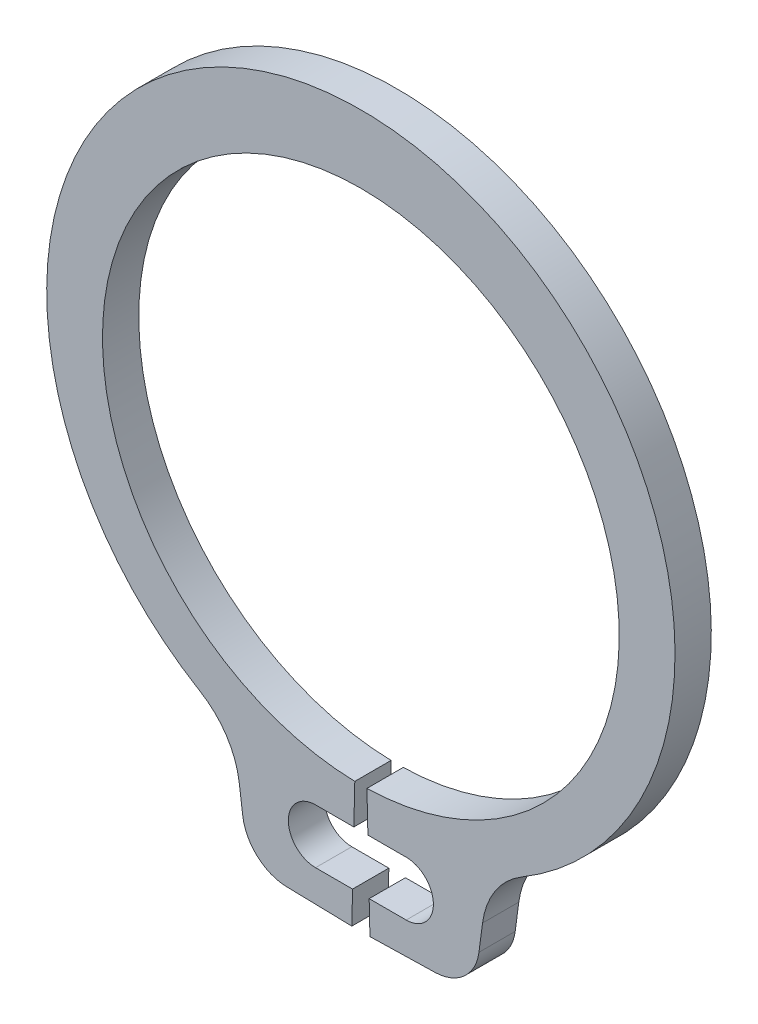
ISO-10303-21;
HEADER;
FILE_DESCRIPTION(('STEP AP214'),'2;1');
FILE_NAME('part.step','',(''),(''),'','','');
FILE_SCHEMA(('AUTOMOTIVE_DESIGN { 1 0 10303 214 1 1 1 1 }'));
ENDSEC;
DATA;
#1=APPLICATION_CONTEXT('core data for automotive mechanical design processes');
#2=APPLICATION_PROTOCOL_DEFINITION('international standard','automotive_design',2000,#1);
#3=PRODUCT_CONTEXT('',#1,'mechanical');
#4=PRODUCT('Part','Part','',(#3));
#5=PRODUCT_RELATED_PRODUCT_CATEGORY('part','',(#4));
#6=PRODUCT_DEFINITION_FORMATION('','',#4);
#7=PRODUCT_DEFINITION_CONTEXT('part definition',#1,'design');
#8=PRODUCT_DEFINITION('design','',#6,#7);
#9=PRODUCT_DEFINITION_SHAPE('','',#8);
#10=(LENGTH_UNIT() NAMED_UNIT(*) SI_UNIT(.MILLI.,.METRE.));
#11=(NAMED_UNIT(*) PLANE_ANGLE_UNIT() SI_UNIT($,.RADIAN.));
#12=(NAMED_UNIT(*) SI_UNIT($,.STERADIAN.) SOLID_ANGLE_UNIT());
#13=UNCERTAINTY_MEASURE_WITH_UNIT(LENGTH_MEASURE(1.E-05),#10,'distance_accuracy_value','');
#14=(GEOMETRIC_REPRESENTATION_CONTEXT(3) GLOBAL_UNCERTAINTY_ASSIGNED_CONTEXT((#13)) GLOBAL_UNIT_ASSIGNED_CONTEXT((#10,
#11,#12)) REPRESENTATION_CONTEXT('',''));
#15=CARTESIAN_POINT('',(0.,0.,0.));
#16=DIRECTION('',(0.,0.,1.));
#17=DIRECTION('',(1.,0.,0.));
#18=AXIS2_PLACEMENT_3D('',#15,#16,#17);
#19=CARTESIAN_POINT('',(-0.0670588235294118,-2.84921096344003,-0.4));
#20=DIRECTION('',(0.999723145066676,-0.0235294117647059,0.));
#21=DIRECTION('',(0.0235294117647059,0.999723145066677,0.));
#22=AXIS2_PLACEMENT_3D('',#19,#20,#21);
#23=PLANE('',#22);
#24=DIRECTION('',(0.,0.,1.));
#25=VECTOR('',#24,1.);
#26=CARTESIAN_POINT('',(-0.0774414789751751,-3.29035165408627,-0.4));
#27=LINE('',#26,#25);
#28=CARTESIAN_POINT('',(-0.077441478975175,-3.29035165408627,-0.4));
#29=VERTEX_POINT('',#28);
#30=CARTESIAN_POINT('',(-0.077441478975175,-3.29035165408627,0.));
#31=VERTEX_POINT('',#30);
#32=EDGE_CURVE('E199',#29,#31,#27,.T.);
#33=ORIENTED_EDGE('',*,*,#32,.F.);
#34=DIRECTION('',(0.0235294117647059,0.999723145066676,0.));
#35=VECTOR('',#34,1.);
#36=CARTESIAN_POINT('',(-0.0670588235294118,-2.84921096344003,-0.4));
#37=LINE('',#36,#35);
#38=CARTESIAN_POINT('',(-0.0670588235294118,-2.84921096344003,-0.4));
#39=VERTEX_POINT('',#38);
#40=EDGE_CURVE('E281',#29,#39,#37,.T.);
#41=ORIENTED_EDGE('',*,*,#40,.T.);
#42=DIRECTION('',(0.,0.,1.));
#43=VECTOR('',#42,1.);
#44=CARTESIAN_POINT('',(-0.0670588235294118,-2.84921096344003,-0.4));
#45=LINE('',#44,#43);
#46=CARTESIAN_POINT('',(-0.0670588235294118,-2.84921096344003,0.));
#47=VERTEX_POINT('',#46);
#48=EDGE_CURVE('E11',#39,#47,#45,.T.);
#49=ORIENTED_EDGE('',*,*,#48,.T.);
#50=DIRECTION('',(0.0235294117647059,0.999723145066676,0.));
#51=VECTOR('',#50,1.);
#52=CARTESIAN_POINT('',(-0.0670588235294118,-2.84921096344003,0.));
#53=LINE('',#52,#51);
#54=EDGE_CURVE('E245',#31,#47,#53,.T.);
#55=ORIENTED_EDGE('',*,*,#54,.F.);
#56=EDGE_LOOP('',(#33,#41,#49,#55));
#57=FACE_BOUND('',#56,.T.);
#58=ADVANCED_FACE('F32',(#57),#23,.T.);
#59=CARTESIAN_POINT('',(0.0670588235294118,-2.84921096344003,-0.4));
#60=DIRECTION('',(-0.999723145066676,-0.0235294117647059,0.));
#61=DIRECTION('',(0.0235294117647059,-0.999723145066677,0.));
#62=AXIS2_PLACEMENT_3D('',#59,#60,#61);
#63=PLANE('',#62);
#64=DIRECTION('',(0.,0.,-1.));
#65=VECTOR('',#64,1.);
#66=CARTESIAN_POINT('',(0.0774414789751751,-3.29035165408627,-0.4));
#67=LINE('',#66,#65);
#68=CARTESIAN_POINT('',(0.0774414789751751,-3.29035165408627,0.));
#69=VERTEX_POINT('',#68);
#70=CARTESIAN_POINT('',(0.0774414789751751,-3.29035165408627,-0.4));
#71=VERTEX_POINT('',#70);
#72=EDGE_CURVE('E203',#69,#71,#67,.T.);
#73=ORIENTED_EDGE('',*,*,#72,.F.);
#74=DIRECTION('',(0.0235294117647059,-0.999723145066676,0.));
#75=VECTOR('',#74,1.);
#76=CARTESIAN_POINT('',(0.0670588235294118,-2.84921096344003,0.));
#77=LINE('',#76,#75);
#78=CARTESIAN_POINT('',(0.0670588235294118,-2.84921096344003,0.));
#79=VERTEX_POINT('',#78);
#80=EDGE_CURVE('E216',#79,#69,#77,.T.);
#81=ORIENTED_EDGE('',*,*,#80,.F.);
#82=DIRECTION('',(0.,0.,1.));
#83=VECTOR('',#82,1.);
#84=CARTESIAN_POINT('',(0.0670588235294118,-2.84921096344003,-0.4));
#85=LINE('',#84,#83);
#86=CARTESIAN_POINT('',(0.0670588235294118,-2.84921096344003,-0.4));
#87=VERTEX_POINT('',#86);
#88=EDGE_CURVE('E36',#87,#79,#85,.T.);
#89=ORIENTED_EDGE('',*,*,#88,.F.);
#90=DIRECTION('',(0.0235294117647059,-0.999723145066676,0.));
#91=VECTOR('',#90,1.);
#92=CARTESIAN_POINT('',(0.0670588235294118,-2.84921096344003,-0.4));
#93=LINE('',#92,#91);
#94=EDGE_CURVE('E251',#87,#71,#93,.T.);
#95=ORIENTED_EDGE('',*,*,#94,.T.);
#96=EDGE_LOOP('',(#73,#81,#89,#95));
#97=FACE_BOUND('',#96,.T.);
#98=ADVANCED_FACE('F315',(#97),#63,.T.);
#99=CARTESIAN_POINT('',(0.,0.,-0.4));
#100=DIRECTION('',(0.,0.,1.));
#101=DIRECTION('',(1.,0.,0.));
#102=AXIS2_PLACEMENT_3D('',#99,#100,#101);
#103=CYLINDRICAL_SURFACE('',#102,2.85);
#104=CARTESIAN_POINT('',(0.,0.,0.));
#105=DIRECTION('',(0.,0.,-1.));
#106=DIRECTION('',(1.,0.,0.));
#107=AXIS2_PLACEMENT_3D('',#104,#105,#106);
#108=CIRCLE('',#107,2.85);
#109=EDGE_CURVE('E212',#47,#79,#108,.T.);
#110=ORIENTED_EDGE('',*,*,#109,.F.);
#111=ORIENTED_EDGE('',*,*,#48,.F.);
#112=CARTESIAN_POINT('',(0.,0.,-0.4));
#113=DIRECTION('',(0.,0.,-1.));
#114=DIRECTION('',(1.,0.,0.));
#115=AXIS2_PLACEMENT_3D('',#112,#113,#114);
#116=CIRCLE('',#115,2.85);
#117=EDGE_CURVE('E247',#39,#87,#116,.T.);
#118=ORIENTED_EDGE('',*,*,#117,.T.);
#119=ORIENTED_EDGE('',*,*,#88,.T.);
#120=EDGE_LOOP('',(#110,#111,#118,#119));
#121=FACE_BOUND('',#120,.T.);
#122=ADVANCED_FACE('F34',(#121),#103,.F.);
#123=DIRECTION('',(0.,0.,-1.));
#124=VECTOR('',#123,1.);
#125=CARTESIAN_POINT('',(-0.091563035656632,-3.89035165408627,-0.4));
#126=LINE('',#125,#124);
#127=CARTESIAN_POINT('',(-0.0915630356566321,-3.89035165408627,0.));
#128=VERTEX_POINT('',#127);
#129=CARTESIAN_POINT('',(-0.0915630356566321,-3.89035165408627,-0.4));
#130=VERTEX_POINT('',#129);
#131=EDGE_CURVE('E337',#128,#130,#126,.T.);
#132=ORIENTED_EDGE('',*,*,#131,.F.);
#133=CARTESIAN_POINT('',(-0.1,-4.24882336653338,0.));
#134=VERTEX_POINT('',#133);
#135=EDGE_CURVE('E193',#134,#128,#53,.T.);
#136=ORIENTED_EDGE('',*,*,#135,.F.);
#137=DIRECTION('',(0.,0.,1.));
#138=VECTOR('',#137,1.);
#139=CARTESIAN_POINT('',(-0.1,-4.24882336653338,-0.4));
#140=LINE('',#139,#138);
#141=CARTESIAN_POINT('',(-0.1,-4.24882336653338,-0.4));
#142=VERTEX_POINT('',#141);
#143=EDGE_CURVE('E41',#142,#134,#140,.T.);
#144=ORIENTED_EDGE('',*,*,#143,.F.);
#145=EDGE_CURVE('E282',#142,#130,#37,.T.);
#146=ORIENTED_EDGE('',*,*,#145,.T.);
#147=EDGE_LOOP('',(#132,#136,#144,#146));
#148=FACE_BOUND('',#147,.T.);
#149=ADVANCED_FACE('F346',(#148),#23,.T.);
#150=CARTESIAN_POINT('',(-0.1,-4.24882336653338,-0.4));
#151=DIRECTION('',(-0.0235294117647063,-0.999723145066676,0.));
#152=DIRECTION('',(0.999723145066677,-0.0235294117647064,0.));
#153=AXIS2_PLACEMENT_3D('',#150,#151,#152);
#154=PLANE('',#153);
#155=DIRECTION('',(0.999723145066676,-0.0235294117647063,0.));
#156=VECTOR('',#155,1.);
#157=CARTESIAN_POINT('',(-0.1,-4.24882336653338,0.));
#158=LINE('',#157,#156);
#159=CARTESIAN_POINT('',(-0.818532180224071,-4.2319120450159,0.));
#160=VERTEX_POINT('',#159);
#161=EDGE_CURVE('E243',#160,#134,#158,.T.);
#162=ORIENTED_EDGE('',*,*,#161,.F.);
#163=DIRECTION('',(0.,0.,1.));
#164=VECTOR('',#163,1.);
#165=CARTESIAN_POINT('',(-0.818532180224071,-4.2319120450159,-0.4));
#166=LINE('',#165,#164);
#167=CARTESIAN_POINT('',(-0.818532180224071,-4.2319120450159,-0.4));
#168=VERTEX_POINT('',#167);
#169=EDGE_CURVE('E286',#168,#160,#166,.T.);
#170=ORIENTED_EDGE('',*,*,#169,.F.);
#171=DIRECTION('',(0.999723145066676,-0.0235294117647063,0.));
#172=VECTOR('',#171,1.);
#173=CARTESIAN_POINT('',(-0.1,-4.24882336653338,-0.4));
#174=LINE('',#173,#172);
#175=EDGE_CURVE('E278',#168,#142,#174,.T.);
#176=ORIENTED_EDGE('',*,*,#175,.T.);
#177=ORIENTED_EDGE('',*,*,#143,.T.);
#178=EDGE_LOOP('',(#162,#170,#176,#177));
#179=FACE_BOUND('',#178,.T.);
#180=ADVANCED_FACE('F349',(#179),#154,.T.);
#181=CARTESIAN_POINT('',(-0.806767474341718,-3.73205047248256,-0.4));
#182=DIRECTION('',(0.,0.,1.));
#183=DIRECTION('',(1.,0.,0.));
#184=AXIS2_PLACEMENT_3D('',#181,#182,#183);
#185=CYLINDRICAL_SURFACE('',#184,0.5);
#186=CARTESIAN_POINT('',(-0.806767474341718,-3.73205047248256,0.));
#187=DIRECTION('',(0.,0.,1.));
#188=DIRECTION('',(1.,0.,0.));
#189=AXIS2_PLACEMENT_3D('',#186,#187,#188);
#190=CIRCLE('',#189,0.5);
#191=CARTESIAN_POINT('',(-1.30248990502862,-3.79731356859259,0.));
#192=VERTEX_POINT('',#191);
#193=EDGE_CURVE('E240',#192,#160,#190,.T.);
#194=ORIENTED_EDGE('',*,*,#193,.F.);
#195=DIRECTION('',(0.,0.,1.));
#196=VECTOR('',#195,1.);
#197=CARTESIAN_POINT('',(-1.30248990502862,-3.79731356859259,-0.4));
#198=LINE('',#197,#196);
#199=CARTESIAN_POINT('',(-1.30248990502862,-3.79731356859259,-0.4));
#200=VERTEX_POINT('',#199);
#201=EDGE_CURVE('E288',#200,#192,#198,.T.);
#202=ORIENTED_EDGE('',*,*,#201,.F.);
#203=CARTESIAN_POINT('',(-0.806767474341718,-3.73205047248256,-0.4));
#204=DIRECTION('',(0.,0.,1.));
#205=DIRECTION('',(1.,0.,0.));
#206=AXIS2_PLACEMENT_3D('',#203,#204,#205);
#207=CIRCLE('',#206,0.5);
#208=EDGE_CURVE('E275',#200,#168,#207,.T.);
#209=ORIENTED_EDGE('',*,*,#208,.T.);
#210=ORIENTED_EDGE('',*,*,#169,.T.);
#211=EDGE_LOOP('',(#194,#202,#209,#210));
#212=FACE_BOUND('',#211,.T.);
#213=ADVANCED_FACE('F354',(#212),#185,.T.);
#214=CARTESIAN_POINT('',(-1.34189484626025,-3.49800332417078,-0.4));
#215=DIRECTION('',(-0.99144486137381,-0.130526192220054,0.));
#216=DIRECTION('',(0.130526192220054,-0.99144486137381,0.));
#217=AXIS2_PLACEMENT_3D('',#214,#215,#216);
#218=PLANE('',#217);
#219=DIRECTION('',(0.130526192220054,-0.99144486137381,0.));
#220=VECTOR('',#219,1.);
#221=CARTESIAN_POINT('',(-1.34189484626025,-3.49800332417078,0.));
#222=LINE('',#221,#220);
#223=CARTESIAN_POINT('',(-1.34189484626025,-3.49800332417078,0.));
#224=VERTEX_POINT('',#223);
#225=EDGE_CURVE('E237',#224,#192,#222,.T.);
#226=ORIENTED_EDGE('',*,*,#225,.F.);
#227=DIRECTION('',(0.,0.,1.));
#228=VECTOR('',#227,1.);
#229=CARTESIAN_POINT('',(-1.34189484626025,-3.49800332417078,-0.4));
#230=LINE('',#229,#228);
#231=CARTESIAN_POINT('',(-1.34189484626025,-3.49800332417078,-0.4));
#232=VERTEX_POINT('',#231);
#233=EDGE_CURVE('E290',#232,#224,#230,.T.);
#234=ORIENTED_EDGE('',*,*,#233,.F.);
#235=DIRECTION('',(0.130526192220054,-0.99144486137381,0.));
#236=VECTOR('',#235,1.);
#237=CARTESIAN_POINT('',(-1.34189484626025,-3.49800332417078,-0.4));
#238=LINE('',#237,#236);
#239=EDGE_CURVE('E272',#232,#200,#238,.T.);
#240=ORIENTED_EDGE('',*,*,#239,.T.);
#241=ORIENTED_EDGE('',*,*,#201,.T.);
#242=EDGE_LOOP('',(#226,#234,#240,#241));
#243=FACE_BOUND('',#242,.T.);
#244=ADVANCED_FACE('F357',(#243),#218,.T.);
#245=CARTESIAN_POINT('',(-2.23404735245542,-3.61545742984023,-0.4));
#246=DIRECTION('',(0.,0.,1.));
#247=DIRECTION('',(1.,0.,0.));
#248=AXIS2_PLACEMENT_3D('',#245,#246,#247);
#249=CYLINDRICAL_SURFACE('',#248,0.899850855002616);
#250=CARTESIAN_POINT('',(-2.23404735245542,-3.61545742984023,0.));
#251=DIRECTION('',(0.,0.,-1.));
#252=DIRECTION('',(1.,0.,0.));
#253=AXIS2_PLACEMENT_3D('',#250,#251,#252);
#254=CIRCLE('',#253,0.899850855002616);
#255=CARTESIAN_POINT('',(-1.77351197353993,-2.84238645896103,0.));
#256=VERTEX_POINT('',#255);
#257=EDGE_CURVE('E234',#256,#224,#254,.T.);
#258=ORIENTED_EDGE('',*,*,#257,.F.);
#259=DIRECTION('',(0.,0.,1.));
#260=VECTOR('',#259,1.);
#261=CARTESIAN_POINT('',(-1.77351197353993,-2.84238645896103,-0.4));
#262=LINE('',#261,#260);
#263=CARTESIAN_POINT('',(-1.77351197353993,-2.84238645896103,-0.4));
#264=VERTEX_POINT('',#263);
#265=EDGE_CURVE('E292',#264,#256,#262,.T.);
#266=ORIENTED_EDGE('',*,*,#265,.F.);
#267=CARTESIAN_POINT('',(-2.23404735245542,-3.61545742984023,-0.4));
#268=DIRECTION('',(0.,0.,-1.));
#269=DIRECTION('',(1.,0.,0.));
#270=AXIS2_PLACEMENT_3D('',#267,#268,#269);
#271=CIRCLE('',#270,0.899850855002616);
#272=EDGE_CURVE('E269',#264,#232,#271,.T.);
#273=ORIENTED_EDGE('',*,*,#272,.T.);
#274=ORIENTED_EDGE('',*,*,#233,.T.);
#275=EDGE_LOOP('',(#258,#266,#273,#274));
#276=FACE_BOUND('',#275,.T.);
#277=ADVANCED_FACE('F362',(#276),#249,.F.);
#278=CARTESIAN_POINT('',(0.,0.134693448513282,-0.4));
#279=DIRECTION('',(0.,0.,1.));
#280=DIRECTION('',(1.,0.,0.));
#281=AXIS2_PLACEMENT_3D('',#278,#279,#280);
#282=CYLINDRICAL_SURFACE('',#281,3.46530655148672);
#283=CARTESIAN_POINT('',(0.,0.134693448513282,0.));
#284=DIRECTION('',(0.,0.,1.));
#285=DIRECTION('',(1.,0.,0.));
#286=AXIS2_PLACEMENT_3D('',#283,#284,#285);
#287=CIRCLE('',#286,3.46530655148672);
#288=CARTESIAN_POINT('',(1.77351197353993,-2.84238645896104,0.));
#289=VERTEX_POINT('',#288);
#290=EDGE_CURVE('E231',#289,#256,#287,.T.);
#291=ORIENTED_EDGE('',*,*,#290,.F.);
#292=DIRECTION('',(0.,0.,1.));
#293=VECTOR('',#292,1.);
#294=CARTESIAN_POINT('',(1.77351197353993,-2.84238645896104,-0.4));
#295=LINE('',#294,#293);
#296=CARTESIAN_POINT('',(1.77351197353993,-2.84238645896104,-0.4));
#297=VERTEX_POINT('',#296);
#298=EDGE_CURVE('E294',#297,#289,#295,.T.);
#299=ORIENTED_EDGE('',*,*,#298,.F.);
#300=CARTESIAN_POINT('',(0.,0.134693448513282,-0.4));
#301=DIRECTION('',(0.,0.,1.));
#302=DIRECTION('',(1.,0.,0.));
#303=AXIS2_PLACEMENT_3D('',#300,#301,#302);
#304=CIRCLE('',#303,3.46530655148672);
#305=EDGE_CURVE('E266',#297,#264,#304,.T.);
#306=ORIENTED_EDGE('',*,*,#305,.T.);
#307=ORIENTED_EDGE('',*,*,#265,.T.);
#308=EDGE_LOOP('',(#291,#299,#306,#307));
#309=FACE_BOUND('',#308,.T.);
#310=ADVANCED_FACE('F365',(#309),#282,.T.);
#311=CARTESIAN_POINT('',(2.23404735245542,-3.61545742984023,-0.4));
#312=DIRECTION('',(0.,0.,1.));
#313=DIRECTION('',(1.,0.,0.));
#314=AXIS2_PLACEMENT_3D('',#311,#312,#313);
#315=CYLINDRICAL_SURFACE('',#314,0.899850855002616);
#316=CARTESIAN_POINT('',(2.23404735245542,-3.61545742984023,0.));
#317=DIRECTION('',(0.,0.,-1.));
#318=DIRECTION('',(1.,0.,0.));
#319=AXIS2_PLACEMENT_3D('',#316,#317,#318);
#320=CIRCLE('',#319,0.899850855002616);
#321=CARTESIAN_POINT('',(1.34189484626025,-3.49800332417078,0.));
#322=VERTEX_POINT('',#321);
#323=EDGE_CURVE('E228',#322,#289,#320,.T.);
#324=ORIENTED_EDGE('',*,*,#323,.F.);
#325=DIRECTION('',(0.,0.,1.));
#326=VECTOR('',#325,1.);
#327=CARTESIAN_POINT('',(1.34189484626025,-3.49800332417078,-0.4));
#328=LINE('',#327,#326);
#329=CARTESIAN_POINT('',(1.34189484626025,-3.49800332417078,-0.4));
#330=VERTEX_POINT('',#329);
#331=EDGE_CURVE('E296',#330,#322,#328,.T.);
#332=ORIENTED_EDGE('',*,*,#331,.F.);
#333=CARTESIAN_POINT('',(2.23404735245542,-3.61545742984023,-0.4));
#334=DIRECTION('',(0.,0.,-1.));
#335=DIRECTION('',(1.,0.,0.));
#336=AXIS2_PLACEMENT_3D('',#333,#334,#335);
#337=CIRCLE('',#336,0.899850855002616);
#338=EDGE_CURVE('E263',#330,#297,#337,.T.);
#339=ORIENTED_EDGE('',*,*,#338,.T.);
#340=ORIENTED_EDGE('',*,*,#298,.T.);
#341=EDGE_LOOP('',(#324,#332,#339,#340));
#342=FACE_BOUND('',#341,.T.);
#343=ADVANCED_FACE('F370',(#342),#315,.F.);
#344=CARTESIAN_POINT('',(1.34189484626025,-3.49800332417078,-0.4));
#345=DIRECTION('',(0.99144486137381,-0.130526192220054,0.));
#346=DIRECTION('',(0.130526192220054,0.99144486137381,0.));
#347=AXIS2_PLACEMENT_3D('',#344,#345,#346);
#348=PLANE('',#347);
#349=DIRECTION('',(0.130526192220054,0.99144486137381,0.));
#350=VECTOR('',#349,1.);
#351=CARTESIAN_POINT('',(1.34189484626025,-3.49800332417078,0.));
#352=LINE('',#351,#350);
#353=CARTESIAN_POINT('',(1.30248990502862,-3.79731356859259,0.));
#354=VERTEX_POINT('',#353);
#355=EDGE_CURVE('E225',#354,#322,#352,.T.);
#356=ORIENTED_EDGE('',*,*,#355,.F.);
#357=DIRECTION('',(0.,0.,1.));
#358=VECTOR('',#357,1.);
#359=CARTESIAN_POINT('',(1.30248990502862,-3.79731356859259,-0.4));
#360=LINE('',#359,#358);
#361=CARTESIAN_POINT('',(1.30248990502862,-3.79731356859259,-0.4));
#362=VERTEX_POINT('',#361);
#363=EDGE_CURVE('E298',#362,#354,#360,.T.);
#364=ORIENTED_EDGE('',*,*,#363,.F.);
#365=DIRECTION('',(0.130526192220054,0.99144486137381,0.));
#366=VECTOR('',#365,1.);
#367=CARTESIAN_POINT('',(1.34189484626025,-3.49800332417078,-0.4));
#368=LINE('',#367,#366);
#369=EDGE_CURVE('E260',#362,#330,#368,.T.);
#370=ORIENTED_EDGE('',*,*,#369,.T.);
#371=ORIENTED_EDGE('',*,*,#331,.T.);
#372=EDGE_LOOP('',(#356,#364,#370,#371));
#373=FACE_BOUND('',#372,.T.);
#374=ADVANCED_FACE('F373',(#373),#348,.T.);
#375=CARTESIAN_POINT('',(0.806767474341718,-3.73205047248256,-0.4));
#376=DIRECTION('',(0.,0.,1.));
#377=DIRECTION('',(1.,0.,0.));
#378=AXIS2_PLACEMENT_3D('',#375,#376,#377);
#379=CYLINDRICAL_SURFACE('',#378,0.5);
#380=CARTESIAN_POINT('',(0.806767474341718,-3.73205047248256,0.));
#381=DIRECTION('',(0.,0.,1.));
#382=DIRECTION('',(-1.,0.,0.));
#383=AXIS2_PLACEMENT_3D('',#380,#381,#382);
#384=CIRCLE('',#383,0.5);
#385=CARTESIAN_POINT('',(0.818532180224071,-4.2319120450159,0.));
#386=VERTEX_POINT('',#385);
#387=EDGE_CURVE('E222',#386,#354,#384,.T.);
#388=ORIENTED_EDGE('',*,*,#387,.F.);
#389=DIRECTION('',(0.,0.,1.));
#390=VECTOR('',#389,1.);
#391=CARTESIAN_POINT('',(0.818532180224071,-4.2319120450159,-0.4));
#392=LINE('',#391,#390);
#393=CARTESIAN_POINT('',(0.818532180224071,-4.2319120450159,-0.4));
#394=VERTEX_POINT('',#393);
#395=EDGE_CURVE('E300',#394,#386,#392,.T.);
#396=ORIENTED_EDGE('',*,*,#395,.F.);
#397=CARTESIAN_POINT('',(0.806767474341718,-3.73205047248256,-0.4));
#398=DIRECTION('',(0.,0.,1.));
#399=DIRECTION('',(-1.,0.,0.));
#400=AXIS2_PLACEMENT_3D('',#397,#398,#399);
#401=CIRCLE('',#400,0.5);
#402=EDGE_CURVE('E257',#394,#362,#401,.T.);
#403=ORIENTED_EDGE('',*,*,#402,.T.);
#404=ORIENTED_EDGE('',*,*,#363,.T.);
#405=EDGE_LOOP('',(#388,#396,#403,#404));
#406=FACE_BOUND('',#405,.T.);
#407=ADVANCED_FACE('F378',(#406),#379,.T.);
#408=CARTESIAN_POINT('',(0.1,-4.24882336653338,-0.4));
#409=DIRECTION('',(0.0235294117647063,-0.999723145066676,0.));
#410=DIRECTION('',(0.999723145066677,0.0235294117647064,0.));
#411=AXIS2_PLACEMENT_3D('',#408,#409,#410);
#412=PLANE('',#411);
#413=DIRECTION('',(0.999723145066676,0.0235294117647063,0.));
#414=VECTOR('',#413,1.);
#415=CARTESIAN_POINT('',(0.1,-4.24882336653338,0.));
#416=LINE('',#415,#414);
#417=CARTESIAN_POINT('',(0.1,-4.24882336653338,0.));
#418=VERTEX_POINT('',#417);
#419=EDGE_CURVE('E219',#418,#386,#416,.T.);
#420=ORIENTED_EDGE('',*,*,#419,.F.);
#421=DIRECTION('',(0.,0.,1.));
#422=VECTOR('',#421,1.);
#423=CARTESIAN_POINT('',(0.1,-4.24882336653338,-0.4));
#424=LINE('',#423,#422);
#425=CARTESIAN_POINT('',(0.1,-4.24882336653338,-0.4));
#426=VERTEX_POINT('',#425);
#427=EDGE_CURVE('E301',#426,#418,#424,.T.);
#428=ORIENTED_EDGE('',*,*,#427,.F.);
#429=DIRECTION('',(0.999723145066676,0.0235294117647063,0.));
#430=VECTOR('',#429,1.);
#431=CARTESIAN_POINT('',(0.1,-4.24882336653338,-0.4));
#432=LINE('',#431,#430);
#433=EDGE_CURVE('E254',#426,#394,#432,.T.);
#434=ORIENTED_EDGE('',*,*,#433,.T.);
#435=ORIENTED_EDGE('',*,*,#395,.T.);
#436=EDGE_LOOP('',(#420,#428,#434,#435));
#437=FACE_BOUND('',#436,.T.);
#438=ADVANCED_FACE('F380',(#437),#412,.T.);
#439=DIRECTION('',(0.,0.,1.));
#440=VECTOR('',#439,1.);
#441=CARTESIAN_POINT('',(0.091563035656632,-3.89035165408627,-0.4));
#442=LINE('',#441,#440);
#443=CARTESIAN_POINT('',(0.0915630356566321,-3.89035165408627,-0.4));
#444=VERTEX_POINT('',#443);
#445=CARTESIAN_POINT('',(0.0915630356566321,-3.89035165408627,0.));
#446=VERTEX_POINT('',#445);
#447=EDGE_CURVE('E333',#444,#446,#442,.T.);
#448=ORIENTED_EDGE('',*,*,#447,.F.);
#449=EDGE_CURVE('E250',#444,#426,#93,.T.);
#450=ORIENTED_EDGE('',*,*,#449,.T.);
#451=ORIENTED_EDGE('',*,*,#427,.T.);
#452=EDGE_CURVE('E215',#446,#418,#77,.T.);
#453=ORIENTED_EDGE('',*,*,#452,.F.);
#454=EDGE_LOOP('',(#448,#450,#451,#453));
#455=FACE_BOUND('',#454,.T.);
#456=ADVANCED_FACE('F383',(#455),#63,.T.);
#457=CARTESIAN_POINT('',(0.,0.,-0.4));
#458=DIRECTION('',(0.,0.,1.));
#459=DIRECTION('',(1.,0.,0.));
#460=AXIS2_PLACEMENT_3D('',#457,#458,#459);
#461=PLANE('',#460);
#462=CARTESIAN_POINT('',(0.5,-3.59035165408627,-0.4));
#463=DIRECTION('',(0.,0.,1.));
#464=DIRECTION('',(1.,0.,0.));
#465=AXIS2_PLACEMENT_3D('',#462,#463,#464);
#466=CIRCLE('',#465,0.3);
#467=CARTESIAN_POINT('',(0.5,-3.89035165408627,-0.4));
#468=VERTEX_POINT('',#467);
#469=CARTESIAN_POINT('',(0.5,-3.29035165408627,-0.4));
#470=VERTEX_POINT('',#469);
#471=EDGE_CURVE('E209',#468,#470,#466,.T.);
#472=ORIENTED_EDGE('',*,*,#471,.T.);
#473=DIRECTION('',(-1.,0.,0.));
#474=VECTOR('',#473,1.);
#475=CARTESIAN_POINT('',(-0.5,-3.29035165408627,-0.4));
#476=LINE('',#475,#474);
#477=EDGE_CURVE('E57',#470,#71,#476,.T.);
#478=ORIENTED_EDGE('',*,*,#477,.T.);
#479=ORIENTED_EDGE('',*,*,#94,.F.);
#480=ORIENTED_EDGE('',*,*,#117,.F.);
#481=ORIENTED_EDGE('',*,*,#40,.F.);
#482=CARTESIAN_POINT('',(-0.5,-3.29035165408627,-0.4));
#483=VERTEX_POINT('',#482);
#484=EDGE_CURVE('E194',#29,#483,#476,.T.);
#485=ORIENTED_EDGE('',*,*,#484,.T.);
#486=CARTESIAN_POINT('',(-0.5,-3.59035165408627,-0.4));
#487=DIRECTION('',(0.,0.,1.));
#488=DIRECTION('',(1.,0.,0.));
#489=AXIS2_PLACEMENT_3D('',#486,#487,#488);
#490=CIRCLE('',#489,0.3);
#491=CARTESIAN_POINT('',(-0.5,-3.89035165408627,-0.4));
#492=VERTEX_POINT('',#491);
#493=EDGE_CURVE('E198',#483,#492,#490,.T.);
#494=ORIENTED_EDGE('',*,*,#493,.T.);
#495=DIRECTION('',(1.,0.,0.));
#496=VECTOR('',#495,1.);
#497=CARTESIAN_POINT('',(0.5,-3.89035165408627,-0.4));
#498=LINE('',#497,#496);
#499=EDGE_CURVE('E176',#492,#130,#498,.T.);
#500=ORIENTED_EDGE('',*,*,#499,.T.);
#501=ORIENTED_EDGE('',*,*,#145,.F.);
#502=ORIENTED_EDGE('',*,*,#175,.F.);
#503=ORIENTED_EDGE('',*,*,#208,.F.);
#504=ORIENTED_EDGE('',*,*,#239,.F.);
#505=ORIENTED_EDGE('',*,*,#272,.F.);
#506=ORIENTED_EDGE('',*,*,#305,.F.);
#507=ORIENTED_EDGE('',*,*,#338,.F.);
#508=ORIENTED_EDGE('',*,*,#369,.F.);
#509=ORIENTED_EDGE('',*,*,#402,.F.);
#510=ORIENTED_EDGE('',*,*,#433,.F.);
#511=ORIENTED_EDGE('',*,*,#449,.F.);
#512=EDGE_CURVE('E326',#444,#468,#498,.T.);
#513=ORIENTED_EDGE('',*,*,#512,.T.);
#514=EDGE_LOOP('',(#472,#478,#479,#480,#481,#485,#494,#500,#501,#502,#503,#504,#505,#506,#507,
#508,#509,#510,#511,#513));
#515=FACE_BOUND('',#514,.T.);
#516=ADVANCED_FACE('F322',(#515),#461,.F.);
#517=CARTESIAN_POINT('',(0.,0.,0.));
#518=DIRECTION('',(0.,0.,1.));
#519=DIRECTION('',(1.,0.,0.));
#520=AXIS2_PLACEMENT_3D('',#517,#518,#519);
#521=PLANE('',#520);
#522=DIRECTION('',(-1.,0.,0.));
#523=VECTOR('',#522,1.);
#524=CARTESIAN_POINT('',(-0.5,-3.29035165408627,0.));
#525=LINE('',#524,#523);
#526=CARTESIAN_POINT('',(0.5,-3.29035165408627,0.));
#527=VERTEX_POINT('',#526);
#528=EDGE_CURVE('E339',#527,#69,#525,.T.);
#529=ORIENTED_EDGE('',*,*,#528,.F.);
#530=CARTESIAN_POINT('',(0.5,-3.59035165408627,0.));
#531=DIRECTION('',(0.,0.,1.));
#532=DIRECTION('',(1.,0.,0.));
#533=AXIS2_PLACEMENT_3D('',#530,#531,#532);
#534=CIRCLE('',#533,0.3);
#535=CARTESIAN_POINT('',(0.5,-3.89035165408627,0.));
#536=VERTEX_POINT('',#535);
#537=EDGE_CURVE('E201',#536,#527,#534,.T.);
#538=ORIENTED_EDGE('',*,*,#537,.F.);
#539=DIRECTION('',(1.,0.,0.));
#540=VECTOR('',#539,1.);
#541=CARTESIAN_POINT('',(0.5,-3.89035165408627,0.));
#542=LINE('',#541,#540);
#543=EDGE_CURVE('E49',#446,#536,#542,.T.);
#544=ORIENTED_EDGE('',*,*,#543,.F.);
#545=ORIENTED_EDGE('',*,*,#452,.T.);
#546=ORIENTED_EDGE('',*,*,#419,.T.);
#547=ORIENTED_EDGE('',*,*,#387,.T.);
#548=ORIENTED_EDGE('',*,*,#355,.T.);
#549=ORIENTED_EDGE('',*,*,#323,.T.);
#550=ORIENTED_EDGE('',*,*,#290,.T.);
#551=ORIENTED_EDGE('',*,*,#257,.T.);
#552=ORIENTED_EDGE('',*,*,#225,.T.);
#553=ORIENTED_EDGE('',*,*,#193,.T.);
#554=ORIENTED_EDGE('',*,*,#161,.T.);
#555=ORIENTED_EDGE('',*,*,#135,.T.);
#556=CARTESIAN_POINT('',(-0.5,-3.89035165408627,0.));
#557=VERTEX_POINT('',#556);
#558=EDGE_CURVE('E173',#557,#128,#542,.T.);
#559=ORIENTED_EDGE('',*,*,#558,.F.);
#560=CARTESIAN_POINT('',(-0.5,-3.59035165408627,0.));
#561=DIRECTION('',(0.,0.,1.));
#562=DIRECTION('',(1.,0.,0.));
#563=AXIS2_PLACEMENT_3D('',#560,#561,#562);
#564=CIRCLE('',#563,0.3);
#565=CARTESIAN_POINT('',(-0.5,-3.29035165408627,0.));
#566=VERTEX_POINT('',#565);
#567=EDGE_CURVE('E190',#566,#557,#564,.T.);
#568=ORIENTED_EDGE('',*,*,#567,.F.);
#569=EDGE_CURVE('E317',#31,#566,#525,.T.);
#570=ORIENTED_EDGE('',*,*,#569,.F.);
#571=ORIENTED_EDGE('',*,*,#54,.T.);
#572=ORIENTED_EDGE('',*,*,#109,.T.);
#573=ORIENTED_EDGE('',*,*,#80,.T.);
#574=EDGE_LOOP('',(#529,#538,#544,#545,#546,#547,#548,#549,#550,#551,#552,#553,#554,#555,#559,
#568,#570,#571,#572,#573));
#575=FACE_BOUND('',#574,.T.);
#576=ADVANCED_FACE('F188',(#575),#521,.T.);
#577=CARTESIAN_POINT('',(0.5,-3.59035165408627,-0.4));
#578=DIRECTION('',(0.,0.,1.));
#579=DIRECTION('',(1.,0.,0.));
#580=AXIS2_PLACEMENT_3D('',#577,#578,#579);
#581=CYLINDRICAL_SURFACE('',#580,0.3);
#582=ORIENTED_EDGE('',*,*,#537,.T.);
#583=DIRECTION('',(0.,0.,1.));
#584=VECTOR('',#583,1.);
#585=CARTESIAN_POINT('',(0.5,-3.29035165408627,-0.4));
#586=LINE('',#585,#584);
#587=EDGE_CURVE('E331',#470,#527,#586,.T.);
#588=ORIENTED_EDGE('',*,*,#587,.F.);
#589=ORIENTED_EDGE('',*,*,#471,.F.);
#590=DIRECTION('',(0.,0.,1.));
#591=VECTOR('',#590,1.);
#592=CARTESIAN_POINT('',(0.5,-3.89035165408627,-0.4));
#593=LINE('',#592,#591);
#594=EDGE_CURVE('E181',#468,#536,#593,.T.);
#595=ORIENTED_EDGE('',*,*,#594,.T.);
#596=EDGE_LOOP('',(#582,#588,#589,#595));
#597=FACE_BOUND('',#596,.T.);
#598=ADVANCED_FACE('F386',(#597),#581,.F.);
#599=CARTESIAN_POINT('',(-0.5,-3.59035165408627,-0.4));
#600=DIRECTION('',(0.,0.,1.));
#601=DIRECTION('',(1.,0.,0.));
#602=AXIS2_PLACEMENT_3D('',#599,#600,#601);
#603=CYLINDRICAL_SURFACE('',#602,0.3);
#604=ORIENTED_EDGE('',*,*,#567,.T.);
#605=DIRECTION('',(0.,0.,1.));
#606=VECTOR('',#605,1.);
#607=CARTESIAN_POINT('',(-0.5,-3.89035165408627,-0.4));
#608=LINE('',#607,#606);
#609=EDGE_CURVE('E170',#492,#557,#608,.T.);
#610=ORIENTED_EDGE('',*,*,#609,.F.);
#611=ORIENTED_EDGE('',*,*,#493,.F.);
#612=DIRECTION('',(0.,0.,1.));
#613=VECTOR('',#612,1.);
#614=CARTESIAN_POINT('',(-0.5,-3.29035165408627,-0.4));
#615=LINE('',#614,#613);
#616=EDGE_CURVE('E182',#483,#566,#615,.T.);
#617=ORIENTED_EDGE('',*,*,#616,.T.);
#618=EDGE_LOOP('',(#604,#610,#611,#617));
#619=FACE_BOUND('',#618,.T.);
#620=ADVANCED_FACE('F197',(#619),#603,.F.);
#621=CARTESIAN_POINT('',(-0.5,-3.29035165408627,-0.4));
#622=DIRECTION('',(0.,1.,0.));
#623=DIRECTION('',(0.,0.,1.));
#624=AXIS2_PLACEMENT_3D('',#621,#622,#623);
#625=PLANE('',#624);
#626=ORIENTED_EDGE('',*,*,#32,.T.);
#627=ORIENTED_EDGE('',*,*,#569,.T.);
#628=ORIENTED_EDGE('',*,*,#616,.F.);
#629=ORIENTED_EDGE('',*,*,#484,.F.);
#630=EDGE_LOOP('',(#626,#627,#628,#629));
#631=FACE_BOUND('',#630,.T.);
#632=ADVANCED_FACE('F342',(#631),#625,.F.);
#633=CARTESIAN_POINT('',(0.5,-3.89035165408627,-0.4));
#634=DIRECTION('',(0.,-1.,0.));
#635=DIRECTION('',(0.,0.,-1.));
#636=AXIS2_PLACEMENT_3D('',#633,#634,#635);
#637=PLANE('',#636);
#638=ORIENTED_EDGE('',*,*,#131,.T.);
#639=ORIENTED_EDGE('',*,*,#499,.F.);
#640=ORIENTED_EDGE('',*,*,#609,.T.);
#641=ORIENTED_EDGE('',*,*,#558,.T.);
#642=EDGE_LOOP('',(#638,#639,#640,#641));
#643=FACE_BOUND('',#642,.T.);
#644=ADVANCED_FACE('F172',(#643),#637,.F.);
#645=ORIENTED_EDGE('',*,*,#447,.T.);
#646=ORIENTED_EDGE('',*,*,#543,.T.);
#647=ORIENTED_EDGE('',*,*,#594,.F.);
#648=ORIENTED_EDGE('',*,*,#512,.F.);
#649=EDGE_LOOP('',(#645,#646,#647,#648));
#650=FACE_BOUND('',#649,.T.);
#651=ADVANCED_FACE('F384',(#650),#637,.F.);
#652=ORIENTED_EDGE('',*,*,#72,.T.);
#653=ORIENTED_EDGE('',*,*,#477,.F.);
#654=ORIENTED_EDGE('',*,*,#587,.T.);
#655=ORIENTED_EDGE('',*,*,#528,.T.);
#656=EDGE_LOOP('',(#652,#653,#654,#655));
#657=FACE_BOUND('',#656,.T.);
#658=ADVANCED_FACE('F338',(#657),#625,.F.);
#659=CLOSED_SHELL('',(#58,#98,#122,#149,#180,#213,#244,#277,#310,#343,#374,#407,#438,#456,#516,
#576,#598,#620,#632,#644,#651,#658));
#660=MANIFOLD_SOLID_BREP('B2',#659);
#661=ADVANCED_BREP_SHAPE_REPRESENTATION('',(#18,#660),#14);
#662=SHAPE_DEFINITION_REPRESENTATION(#9,#661);
ENDSEC;
END-ISO-10303-21;
